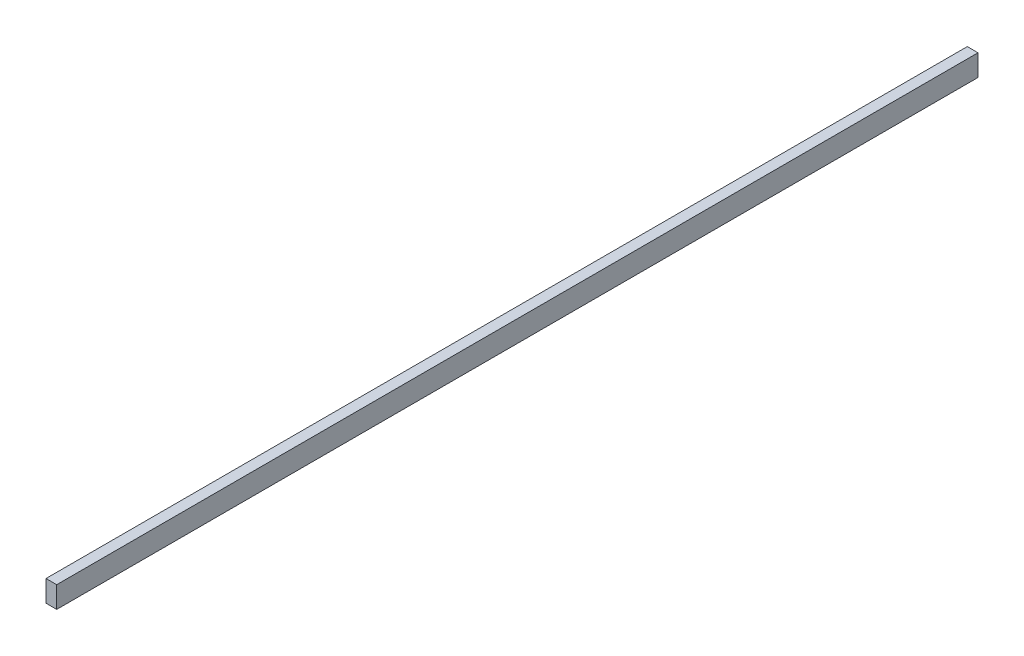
ISO-10303-21;
HEADER;
FILE_DESCRIPTION(('STEP AP214'),'2;1');
FILE_NAME('part.step','',(''),(''),'','','');
FILE_SCHEMA(('AUTOMOTIVE_DESIGN { 1 0 10303 214 1 1 1 1 }'));
ENDSEC;
DATA;
#1=APPLICATION_CONTEXT('core data for automotive mechanical design processes');
#2=APPLICATION_PROTOCOL_DEFINITION('international standard','automotive_design',2000,#1);
#3=PRODUCT_CONTEXT('',#1,'mechanical');
#4=PRODUCT('Part','Part','',(#3));
#5=PRODUCT_RELATED_PRODUCT_CATEGORY('part','',(#4));
#6=PRODUCT_DEFINITION_FORMATION('','',#4);
#7=PRODUCT_DEFINITION_CONTEXT('part definition',#1,'design');
#8=PRODUCT_DEFINITION('design','',#6,#7);
#9=PRODUCT_DEFINITION_SHAPE('','',#8);
#10=(LENGTH_UNIT() NAMED_UNIT(*) SI_UNIT(.MILLI.,.METRE.));
#11=(NAMED_UNIT(*) PLANE_ANGLE_UNIT() SI_UNIT($,.RADIAN.));
#12=(NAMED_UNIT(*) SI_UNIT($,.STERADIAN.) SOLID_ANGLE_UNIT());
#13=UNCERTAINTY_MEASURE_WITH_UNIT(LENGTH_MEASURE(1.E-05),#10,'distance_accuracy_value','');
#14=(GEOMETRIC_REPRESENTATION_CONTEXT(3) GLOBAL_UNCERTAINTY_ASSIGNED_CONTEXT((#13)) GLOBAL_UNIT_ASSIGNED_CONTEXT((#10,
#11,#12)) REPRESENTATION_CONTEXT('',''));
#15=CARTESIAN_POINT('',(0.,0.,0.));
#16=DIRECTION('',(0.,0.,1.));
#17=DIRECTION('',(1.,0.,0.));
#18=AXIS2_PLACEMENT_3D('',#15,#16,#17);
#19=CARTESIAN_POINT('',(0.,0.,430.));
#20=DIRECTION('',(1.,0.,0.));
#21=DIRECTION('',(0.,0.,-1.));
#22=AXIS2_PLACEMENT_3D('',#19,#20,#21);
#23=PLANE('',#22);
#24=DIRECTION('',(0.,-1.,0.));
#25=VECTOR('',#24,1.);
#26=CARTESIAN_POINT('',(0.,0.,0.));
#27=LINE('',#26,#25);
#28=CARTESIAN_POINT('',(0.,10.,0.));
#29=VERTEX_POINT('',#28);
#30=CARTESIAN_POINT('',(0.,0.,0.));
#31=VERTEX_POINT('',#30);
#32=EDGE_CURVE('E70',#29,#31,#27,.T.);
#33=ORIENTED_EDGE('',*,*,#32,.T.);
#34=DIRECTION('',(0.,0.,-1.));
#35=VECTOR('',#34,1.);
#36=CARTESIAN_POINT('',(0.,0.,430.));
#37=LINE('',#36,#35);
#38=CARTESIAN_POINT('',(0.,0.,430.));
#39=VERTEX_POINT('',#38);
#40=EDGE_CURVE('E11',#39,#31,#37,.T.);
#41=ORIENTED_EDGE('',*,*,#40,.F.);
#42=DIRECTION('',(0.,-1.,0.));
#43=VECTOR('',#42,1.);
#44=CARTESIAN_POINT('',(0.,0.,430.));
#45=LINE('',#44,#43);
#46=CARTESIAN_POINT('',(0.,10.,430.));
#47=VERTEX_POINT('',#46);
#48=EDGE_CURVE('E88',#47,#39,#45,.T.);
#49=ORIENTED_EDGE('',*,*,#48,.F.);
#50=DIRECTION('',(0.,0.,-1.));
#51=VECTOR('',#50,1.);
#52=CARTESIAN_POINT('',(0.,10.,430.));
#53=LINE('',#52,#51);
#54=EDGE_CURVE('E82',#47,#29,#53,.T.);
#55=ORIENTED_EDGE('',*,*,#54,.T.);
#56=EDGE_LOOP('',(#33,#41,#49,#55));
#57=FACE_BOUND('',#56,.T.);
#58=ADVANCED_FACE('F26',(#57),#23,.F.);
#59=CARTESIAN_POINT('',(0.,0.,430.));
#60=DIRECTION('',(0.,1.,0.));
#61=DIRECTION('',(0.,0.,1.));
#62=AXIS2_PLACEMENT_3D('',#59,#60,#61);
#63=PLANE('',#62);
#64=DIRECTION('',(1.,0.,0.));
#65=VECTOR('',#64,1.);
#66=CARTESIAN_POINT('',(0.,0.,0.));
#67=LINE('',#66,#65);
#68=CARTESIAN_POINT('',(5.,0.,0.));
#69=VERTEX_POINT('',#68);
#70=EDGE_CURVE('E66',#31,#69,#67,.T.);
#71=ORIENTED_EDGE('',*,*,#70,.T.);
#72=DIRECTION('',(0.,0.,-1.));
#73=VECTOR('',#72,1.);
#74=CARTESIAN_POINT('',(5.,0.,430.));
#75=LINE('',#74,#73);
#76=CARTESIAN_POINT('',(5.,0.,430.));
#77=VERTEX_POINT('',#76);
#78=EDGE_CURVE('E33',#77,#69,#75,.T.);
#79=ORIENTED_EDGE('',*,*,#78,.F.);
#80=DIRECTION('',(1.,0.,0.));
#81=VECTOR('',#80,1.);
#82=CARTESIAN_POINT('',(0.,0.,430.));
#83=LINE('',#82,#81);
#84=EDGE_CURVE('E78',#39,#77,#83,.T.);
#85=ORIENTED_EDGE('',*,*,#84,.F.);
#86=ORIENTED_EDGE('',*,*,#40,.T.);
#87=EDGE_LOOP('',(#71,#79,#85,#86));
#88=FACE_BOUND('',#87,.T.);
#89=ADVANCED_FACE('F77',(#88),#63,.F.);
#90=CARTESIAN_POINT('',(5.,0.,430.));
#91=DIRECTION('',(-1.,0.,0.));
#92=DIRECTION('',(0.,0.,1.));
#93=AXIS2_PLACEMENT_3D('',#90,#91,#92);
#94=PLANE('',#93);
#95=DIRECTION('',(0.,1.,0.));
#96=VECTOR('',#95,1.);
#97=CARTESIAN_POINT('',(5.,0.,0.));
#98=LINE('',#97,#96);
#99=CARTESIAN_POINT('',(5.,10.,0.));
#100=VERTEX_POINT('',#99);
#101=EDGE_CURVE('E71',#69,#100,#98,.T.);
#102=ORIENTED_EDGE('',*,*,#101,.T.);
#103=DIRECTION('',(0.,0.,-1.));
#104=VECTOR('',#103,1.);
#105=CARTESIAN_POINT('',(5.,10.,430.));
#106=LINE('',#105,#104);
#107=CARTESIAN_POINT('',(5.,10.,430.));
#108=VERTEX_POINT('',#107);
#109=EDGE_CURVE('E94',#108,#100,#106,.T.);
#110=ORIENTED_EDGE('',*,*,#109,.F.);
#111=DIRECTION('',(0.,1.,0.));
#112=VECTOR('',#111,1.);
#113=CARTESIAN_POINT('',(5.,0.,430.));
#114=LINE('',#113,#112);
#115=EDGE_CURVE('E45',#77,#108,#114,.T.);
#116=ORIENTED_EDGE('',*,*,#115,.F.);
#117=ORIENTED_EDGE('',*,*,#78,.T.);
#118=EDGE_LOOP('',(#102,#110,#116,#117));
#119=FACE_BOUND('',#118,.T.);
#120=ADVANCED_FACE('F97',(#119),#94,.F.);
#121=CARTESIAN_POINT('',(0.,10.,430.));
#122=DIRECTION('',(0.,-1.,0.));
#123=DIRECTION('',(0.,0.,-1.));
#124=AXIS2_PLACEMENT_3D('',#121,#122,#123);
#125=PLANE('',#124);
#126=DIRECTION('',(-1.,0.,0.));
#127=VECTOR('',#126,1.);
#128=CARTESIAN_POINT('',(0.,10.,0.));
#129=LINE('',#128,#127);
#130=EDGE_CURVE('E86',#100,#29,#129,.T.);
#131=ORIENTED_EDGE('',*,*,#130,.T.);
#132=ORIENTED_EDGE('',*,*,#54,.F.);
#133=DIRECTION('',(-1.,0.,0.));
#134=VECTOR('',#133,1.);
#135=CARTESIAN_POINT('',(0.,10.,430.));
#136=LINE('',#135,#134);
#137=EDGE_CURVE('E40',#108,#47,#136,.T.);
#138=ORIENTED_EDGE('',*,*,#137,.F.);
#139=ORIENTED_EDGE('',*,*,#109,.T.);
#140=EDGE_LOOP('',(#131,#132,#138,#139));
#141=FACE_BOUND('',#140,.T.);
#142=ADVANCED_FACE('F99',(#141),#125,.F.);
#143=CARTESIAN_POINT('',(0.,10.,430.));
#144=DIRECTION('',(0.,0.,-1.));
#145=DIRECTION('',(-1.,0.,0.));
#146=AXIS2_PLACEMENT_3D('',#143,#144,#145);
#147=PLANE('',#146);
#148=ORIENTED_EDGE('',*,*,#48,.T.);
#149=ORIENTED_EDGE('',*,*,#84,.T.);
#150=ORIENTED_EDGE('',*,*,#115,.T.);
#151=ORIENTED_EDGE('',*,*,#137,.T.);
#152=EDGE_LOOP('',(#148,#149,#150,#151));
#153=FACE_BOUND('',#152,.T.);
#154=ADVANCED_FACE('F100',(#153),#147,.F.);
#155=CARTESIAN_POINT('',(0.,10.,0.));
#156=DIRECTION('',(0.,0.,-1.));
#157=DIRECTION('',(-1.,0.,0.));
#158=AXIS2_PLACEMENT_3D('',#155,#156,#157);
#159=PLANE('',#158);
#160=ORIENTED_EDGE('',*,*,#32,.F.);
#161=ORIENTED_EDGE('',*,*,#130,.F.);
#162=ORIENTED_EDGE('',*,*,#101,.F.);
#163=ORIENTED_EDGE('',*,*,#70,.F.);
#164=EDGE_LOOP('',(#160,#161,#162,#163));
#165=FACE_BOUND('',#164,.T.);
#166=ADVANCED_FACE('F67',(#165),#159,.T.);
#167=CLOSED_SHELL('',(#58,#89,#120,#142,#154,#166));
#168=MANIFOLD_SOLID_BREP('B2',#167);
#169=ADVANCED_BREP_SHAPE_REPRESENTATION('',(#18,#168),#14);
#170=SHAPE_DEFINITION_REPRESENTATION(#9,#169);
ENDSEC;
END-ISO-10303-21;
